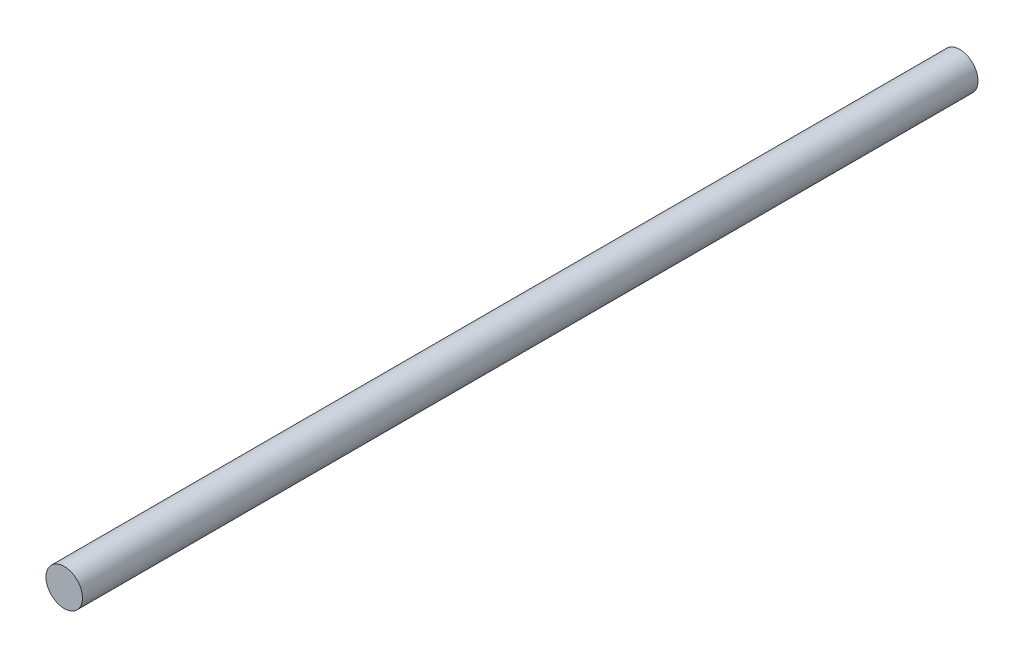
from build123d import *

# Parameters (mm, degrees)
SKETCH1_R           = 15
BOSS_EXTRUDE1_DEPTH = 736


with BuildPart() as part:
    # Sketch1 → Boss-Extrude1 (new body)
    with BuildSketch(Plane.XY):
        Circle(SKETCH1_R)
    extrude(amount=BOSS_EXTRUDE1_DEPTH)


solid = part.part
